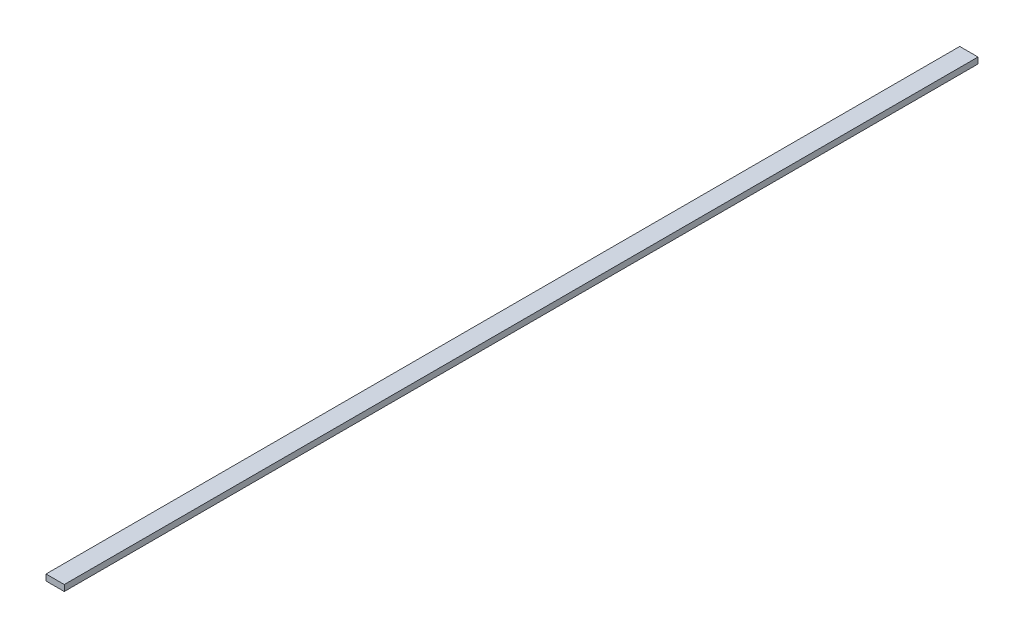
ISO-10303-21;
HEADER;
FILE_DESCRIPTION(('STEP AP214'),'2;1');
FILE_NAME('part.step','',(''),(''),'','','');
FILE_SCHEMA(('AUTOMOTIVE_DESIGN { 1 0 10303 214 1 1 1 1 }'));
ENDSEC;
DATA;
#1=APPLICATION_CONTEXT('core data for automotive mechanical design processes');
#2=APPLICATION_PROTOCOL_DEFINITION('international standard','automotive_design',2000,#1);
#3=PRODUCT_CONTEXT('',#1,'mechanical');
#4=PRODUCT('Part','Part','',(#3));
#5=PRODUCT_RELATED_PRODUCT_CATEGORY('part','',(#4));
#6=PRODUCT_DEFINITION_FORMATION('','',#4);
#7=PRODUCT_DEFINITION_CONTEXT('part definition',#1,'design');
#8=PRODUCT_DEFINITION('design','',#6,#7);
#9=PRODUCT_DEFINITION_SHAPE('','',#8);
#10=(LENGTH_UNIT() NAMED_UNIT(*) SI_UNIT(.MILLI.,.METRE.));
#11=(NAMED_UNIT(*) PLANE_ANGLE_UNIT() SI_UNIT($,.RADIAN.));
#12=(NAMED_UNIT(*) SI_UNIT($,.STERADIAN.) SOLID_ANGLE_UNIT());
#13=UNCERTAINTY_MEASURE_WITH_UNIT(LENGTH_MEASURE(1.E-05),#10,'distance_accuracy_value','');
#14=(GEOMETRIC_REPRESENTATION_CONTEXT(3) GLOBAL_UNCERTAINTY_ASSIGNED_CONTEXT((#13)) GLOBAL_UNIT_ASSIGNED_CONTEXT((#10,
#11,#12)) REPRESENTATION_CONTEXT('',''));
#15=CARTESIAN_POINT('',(0.,0.,0.));
#16=DIRECTION('',(0.,0.,1.));
#17=DIRECTION('',(1.,0.,0.));
#18=AXIS2_PLACEMENT_3D('',#15,#16,#17);
#19=CARTESIAN_POINT('',(4.76249999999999,-1.5875,476.25));
#20=DIRECTION('',(-1.,0.,0.));
#21=DIRECTION('',(0.,0.,1.));
#22=AXIS2_PLACEMENT_3D('',#19,#20,#21);
#23=PLANE('',#22);
#24=DIRECTION('',(0.,1.,0.));
#25=VECTOR('',#24,1.);
#26=CARTESIAN_POINT('',(4.76249999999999,-1.5875,0.));
#27=LINE('',#26,#25);
#28=CARTESIAN_POINT('',(4.76249999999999,-1.5875,0.));
#29=VERTEX_POINT('',#28);
#30=CARTESIAN_POINT('',(4.76249999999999,1.5875,0.));
#31=VERTEX_POINT('',#30);
#32=EDGE_CURVE('E114',#29,#31,#27,.T.);
#33=ORIENTED_EDGE('',*,*,#32,.T.);
#34=DIRECTION('',(0.,0.,-1.));
#35=VECTOR('',#34,1.);
#36=CARTESIAN_POINT('',(4.76249999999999,1.5875,476.25));
#37=LINE('',#36,#35);
#38=CARTESIAN_POINT('',(4.76249999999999,1.5875,476.25));
#39=VERTEX_POINT('',#38);
#40=EDGE_CURVE('E11',#39,#31,#37,.T.);
#41=ORIENTED_EDGE('',*,*,#40,.F.);
#42=DIRECTION('',(0.,1.,0.));
#43=VECTOR('',#42,1.);
#44=CARTESIAN_POINT('',(4.76249999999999,-1.5875,476.25));
#45=LINE('',#44,#43);
#46=CARTESIAN_POINT('',(4.76249999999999,-1.5875,476.25));
#47=VERTEX_POINT('',#46);
#48=EDGE_CURVE('E97',#47,#39,#45,.T.);
#49=ORIENTED_EDGE('',*,*,#48,.F.);
#50=DIRECTION('',(0.,0.,-1.));
#51=VECTOR('',#50,1.);
#52=CARTESIAN_POINT('',(4.76249999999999,-1.5875,476.25));
#53=LINE('',#52,#51);
#54=EDGE_CURVE('E110',#47,#29,#53,.T.);
#55=ORIENTED_EDGE('',*,*,#54,.T.);
#56=EDGE_LOOP('',(#33,#41,#49,#55));
#57=FACE_BOUND('',#56,.T.);
#58=ADVANCED_FACE('F45',(#57),#23,.F.);
#59=CARTESIAN_POINT('',(-4.76250000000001,1.5875,476.25));
#60=DIRECTION('',(0.,-1.,0.));
#61=DIRECTION('',(0.,0.,-1.));
#62=AXIS2_PLACEMENT_3D('',#59,#60,#61);
#63=PLANE('',#62);
#64=DIRECTION('',(-1.,0.,0.));
#65=VECTOR('',#64,1.);
#66=CARTESIAN_POINT('',(-4.76250000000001,1.5875,0.));
#67=LINE('',#66,#65);
#68=CARTESIAN_POINT('',(-4.76250000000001,1.5875,0.));
#69=VERTEX_POINT('',#68);
#70=EDGE_CURVE('E102',#31,#69,#67,.T.);
#71=ORIENTED_EDGE('',*,*,#70,.T.);
#72=DIRECTION('',(0.,0.,-1.));
#73=VECTOR('',#72,1.);
#74=CARTESIAN_POINT('',(-4.76250000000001,1.5875,476.25));
#75=LINE('',#74,#73);
#76=CARTESIAN_POINT('',(-4.76250000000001,1.5875,476.25));
#77=VERTEX_POINT('',#76);
#78=EDGE_CURVE('E54',#77,#69,#75,.T.);
#79=ORIENTED_EDGE('',*,*,#78,.F.);
#80=DIRECTION('',(-1.,0.,0.));
#81=VECTOR('',#80,1.);
#82=CARTESIAN_POINT('',(-4.76250000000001,1.5875,476.25));
#83=LINE('',#82,#81);
#84=EDGE_CURVE('E92',#39,#77,#83,.T.);
#85=ORIENTED_EDGE('',*,*,#84,.F.);
#86=ORIENTED_EDGE('',*,*,#40,.T.);
#87=EDGE_LOOP('',(#71,#79,#85,#86));
#88=FACE_BOUND('',#87,.T.);
#89=ADVANCED_FACE('F101',(#88),#63,.F.);
#90=CARTESIAN_POINT('',(-4.76250000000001,-1.5875,476.25));
#91=DIRECTION('',(1.,0.,0.));
#92=DIRECTION('',(0.,0.,-1.));
#93=AXIS2_PLACEMENT_3D('',#90,#91,#92);
#94=PLANE('',#93);
#95=DIRECTION('',(0.,-1.,0.));
#96=VECTOR('',#95,1.);
#97=CARTESIAN_POINT('',(-4.76250000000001,-1.5875,0.));
#98=LINE('',#97,#96);
#99=CARTESIAN_POINT('',(-4.76250000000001,-1.5875,0.));
#100=VERTEX_POINT('',#99);
#101=EDGE_CURVE('E79',#69,#100,#98,.T.);
#102=ORIENTED_EDGE('',*,*,#101,.T.);
#103=DIRECTION('',(0.,0.,-1.));
#104=VECTOR('',#103,1.);
#105=CARTESIAN_POINT('',(-4.76250000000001,-1.5875,476.25));
#106=LINE('',#105,#104);
#107=CARTESIAN_POINT('',(-4.76250000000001,-1.5875,476.25));
#108=VERTEX_POINT('',#107);
#109=EDGE_CURVE('E104',#108,#100,#106,.T.);
#110=ORIENTED_EDGE('',*,*,#109,.F.);
#111=DIRECTION('',(0.,-1.,0.));
#112=VECTOR('',#111,1.);
#113=CARTESIAN_POINT('',(-4.76250000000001,-1.5875,476.25));
#114=LINE('',#113,#112);
#115=EDGE_CURVE('E95',#77,#108,#114,.T.);
#116=ORIENTED_EDGE('',*,*,#115,.F.);
#117=ORIENTED_EDGE('',*,*,#78,.T.);
#118=EDGE_LOOP('',(#102,#110,#116,#117));
#119=FACE_BOUND('',#118,.T.);
#120=ADVANCED_FACE('F105',(#119),#94,.F.);
#121=CARTESIAN_POINT('',(-4.76250000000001,-1.5875,476.25));
#122=DIRECTION('',(0.,1.,0.));
#123=DIRECTION('',(0.,0.,1.));
#124=AXIS2_PLACEMENT_3D('',#121,#122,#123);
#125=PLANE('',#124);
#126=DIRECTION('',(1.,0.,0.));
#127=VECTOR('',#126,1.);
#128=CARTESIAN_POINT('',(-4.76250000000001,-1.5875,0.));
#129=LINE('',#128,#127);
#130=EDGE_CURVE('E85',#100,#29,#129,.T.);
#131=ORIENTED_EDGE('',*,*,#130,.T.);
#132=ORIENTED_EDGE('',*,*,#54,.F.);
#133=DIRECTION('',(1.,0.,0.));
#134=VECTOR('',#133,1.);
#135=CARTESIAN_POINT('',(-4.76250000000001,-1.5875,476.25));
#136=LINE('',#135,#134);
#137=EDGE_CURVE('E62',#108,#47,#136,.T.);
#138=ORIENTED_EDGE('',*,*,#137,.F.);
#139=ORIENTED_EDGE('',*,*,#109,.T.);
#140=EDGE_LOOP('',(#131,#132,#138,#139));
#141=FACE_BOUND('',#140,.T.);
#142=ADVANCED_FACE('F128',(#141),#125,.F.);
#143=CARTESIAN_POINT('',(0.,0.,476.25));
#144=DIRECTION('',(0.,0.,-1.));
#145=DIRECTION('',(-1.,0.,0.));
#146=AXIS2_PLACEMENT_3D('',#143,#144,#145);
#147=PLANE('',#146);
#148=ORIENTED_EDGE('',*,*,#48,.T.);
#149=ORIENTED_EDGE('',*,*,#84,.T.);
#150=ORIENTED_EDGE('',*,*,#115,.T.);
#151=ORIENTED_EDGE('',*,*,#137,.T.);
#152=EDGE_LOOP('',(#148,#149,#150,#151));
#153=FACE_BOUND('',#152,.T.);
#154=ADVANCED_FACE('F93',(#153),#147,.F.);
#155=CARTESIAN_POINT('',(0.,0.,0.));
#156=DIRECTION('',(0.,0.,-1.));
#157=DIRECTION('',(-1.,0.,0.));
#158=AXIS2_PLACEMENT_3D('',#155,#156,#157);
#159=PLANE('',#158);
#160=ORIENTED_EDGE('',*,*,#32,.F.);
#161=ORIENTED_EDGE('',*,*,#130,.F.);
#162=ORIENTED_EDGE('',*,*,#101,.F.);
#163=ORIENTED_EDGE('',*,*,#70,.F.);
#164=EDGE_LOOP('',(#160,#161,#162,#163));
#165=FACE_BOUND('',#164,.T.);
#166=ADVANCED_FACE('F131',(#165),#159,.T.);
#167=CLOSED_SHELL('',(#58,#89,#120,#142,#154,#166));
#168=MANIFOLD_SOLID_BREP('B2',#167);
#169=ADVANCED_BREP_SHAPE_REPRESENTATION('',(#18,#168),#14);
#170=SHAPE_DEFINITION_REPRESENTATION(#9,#169);
ENDSEC;
END-ISO-10303-21;
